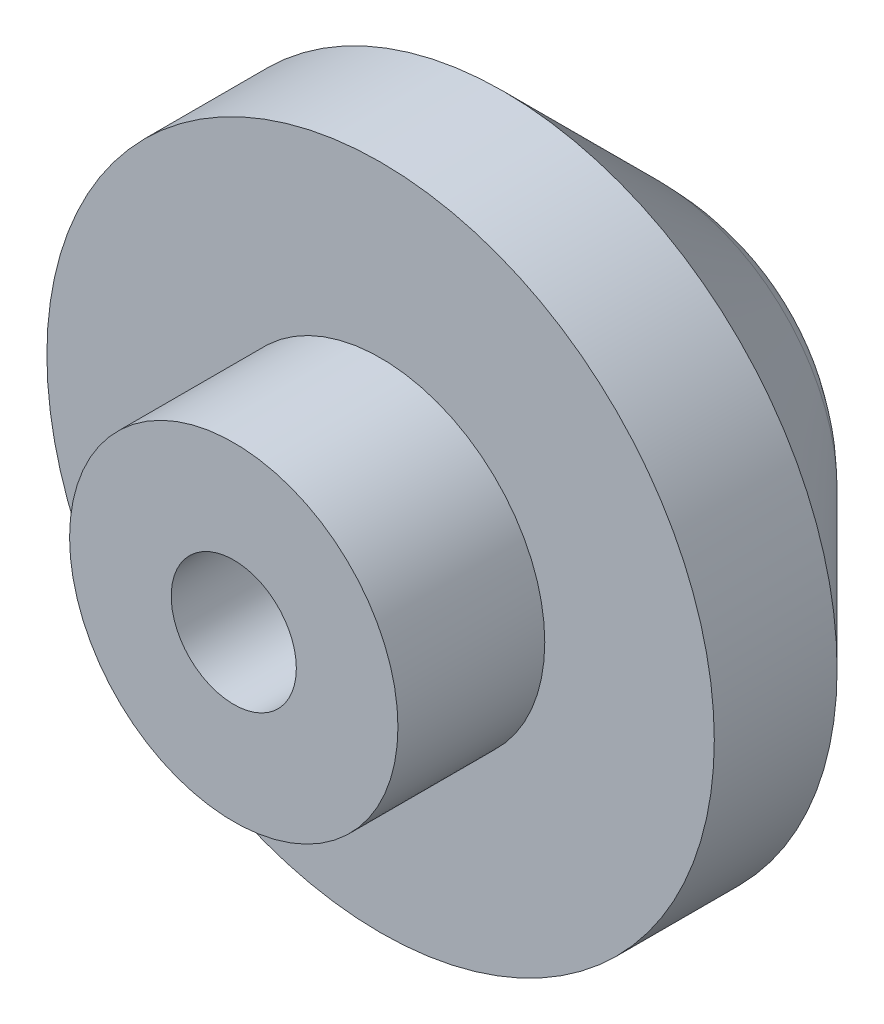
from build123d import *

# Parameters (mm, degrees)
F_3_64_0_04688_DIAMETER_HOLE1_D     = 1.190752
F_3_64_0_04688_DIAMETER_HOLE1_DEPTH = 1.5875
F_3_64_0_04688_DIAMETER_HOLE1_TIP   = 0.684901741


with BuildPart() as part:
    # Sketch1 → Revolve1 (revolve)
    with BuildSketch(Plane(origin=(0, 0, 0), x_dir=(0, 0, -1), z_dir=(1, 0, 0)), mode=Mode.PRIVATE) as revolve1_sk:
        with BuildLine():
            Line((-2.3749, 0), (-2.3749, 1.5621))
            Line((-2.3749, 1.5621), (-0.9779, 1.5621))
            Line((-0.9779, 1.5621), (-0.9779, 3.175))
            Line((-0.9779, 3.175), (0.1905, 3.175))
            Line((0.1905, 3.175), (1.674440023, 1.691059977))
            ThreePointArc((1.674440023, 1.691059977), (2.192856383, 0.915195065), (2.3749, 0))
            Line((2.3749, 0), (-2.3749, 0))
        make_face()
    revolve(revolve1_sk.sketch.rotate(Axis((0, 0, 5.155644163), (0, 0, -1)), 90), axis=Axis((0, 0, 5.155644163), (0, 0, -1)))

    # 3_64 _0.04688_ Diameter Hole1
    with Locations(Plane.XY.offset(2.3749)):
        with Locations((0, 0)):
            Hole(F_3_64_0_04688_DIAMETER_HOLE1_D / 2, depth=F_3_64_0_04688_DIAMETER_HOLE1_DEPTH)
            with Locations((0, 0, -(F_3_64_0_04688_DIAMETER_HOLE1_DEPTH + F_3_64_0_04688_DIAMETER_HOLE1_TIP / 2))):  # 82° drill point
                Cone(0, F_3_64_0_04688_DIAMETER_HOLE1_D / 2, F_3_64_0_04688_DIAMETER_HOLE1_TIP, mode=Mode.SUBTRACT)


solid = part.part
